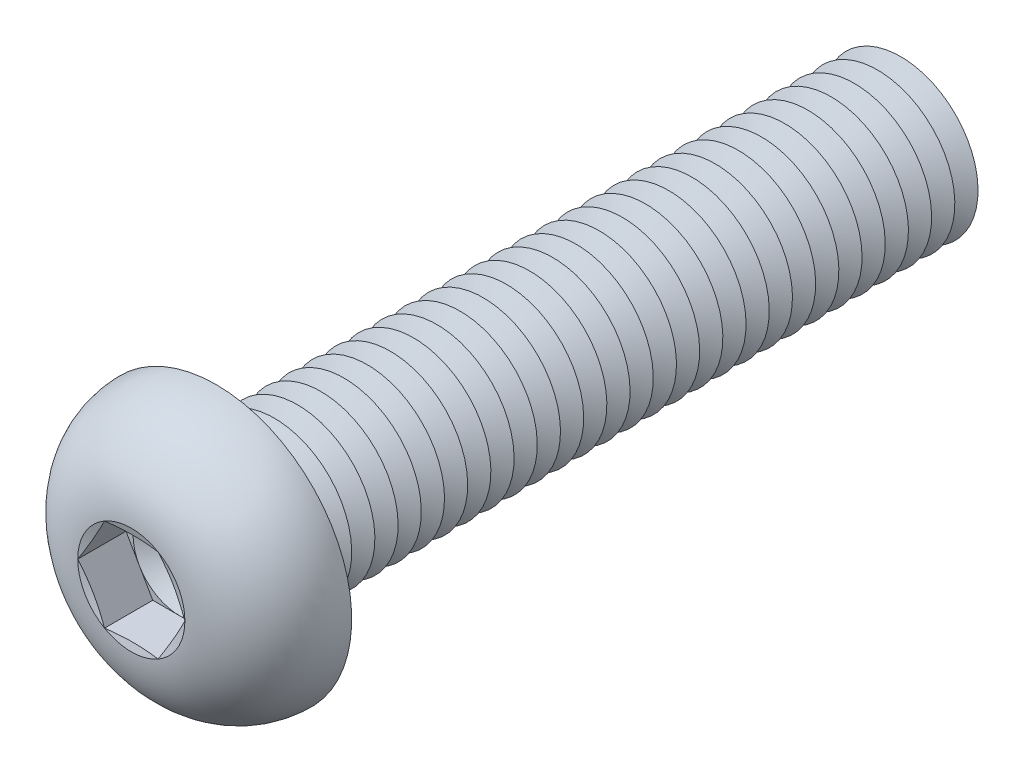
from build123d import *

# Parameters (mm, degrees)
FILLET1_R          = 0.75
LPATTERN1_COUNT    = 30
LPATTERN1_PITCH    = 1.5
CUT_EXTRUDE1_DEPTH = 3.12


with BuildPart() as part:
    # Sketch1 → Revolve1 (revolve)
    with BuildSketch(Plane(origin=(0, 0, 0), x_dir=(0, 0, -1), z_dir=(1, 0, 0))):
        with BuildLine():
            Line((0, 5), (0, 8.75))
            ThreePointArc((0, 8.75), (-3.814142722, 7.21429474), (-5.5, 3.4641))
            Line((-5.5, 3.4641), (-5.035898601, 1.73205))
            Line((-5.035898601, 1.73205), (-5.5, 1.73205))
            Line((-5.5, 1.73205), (-5.5, 0))
            Line((-5.5, 0), (45, 0))
            Line((45, 0), (45, 5))
            Line((45, 5), (0, 5))
        make_face()
    revolve(axis=Axis((0, 0, -45), (0, 0, 1)))

    # Fillet1
    fillet1_edges = [part.edges().sort_by_distance(p)[0] for p in [
        (0, -5, 0),
    ]]
    fillet(fillet1_edges, radius=FILLET1_R)

    # Sketch2 → Cut-Revolve1 (revolve, cut)
    with BuildSketch(Plane(origin=(0, 0, 0), x_dir=(0, 0, -1), z_dir=(1, 0, 0))):
        Polygon((44.25, 5), (45.75, 5), (45, 3.700961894), align=None)
    cut_revolve1 = revolve(axis=Axis((0, 0, -45), (0, 0, -1)), mode=Mode.SUBTRACT)

    # LPattern1: Cut-Revolve1 ×30
    with Locations(*[(0, 0, i * LPATTERN1_PITCH) for i in range(1, LPATTERN1_COUNT)]):
        add(cut_revolve1, mode=Mode.SUBTRACT)

    # Sketch3 → Cut-Extrude1 (cut)
    with BuildSketch(Plane.XY.offset(5.5)):
        Polygon((1.73205, 2.999998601), (-1.73205, 2.999998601), (-3.4641, 0), (-1.73205, -2.999998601), (1.73205, -2.999998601), (3.4641, 0), align=None)
    extrude(amount=-CUT_EXTRUDE1_DEPTH, mode=Mode.SUBTRACT)

    # Cut-Extrude2 cone 1 section (on through the dimple's axis) → Cut-Extrude2 (revolve, cut)
    with BuildSketch(Plane(origin=(0, 0, 2.38), x_dir=(0, -1, 0), z_dir=(1, 0, 0))):
        Polygon((0, 0), (2.999998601, 0), (0, 1.73205), align=None)
    revolve(axis=Axis((0, 0, 2.38), (0, 0, -1)), mode=Mode.SUBTRACT)


solid = part.part
